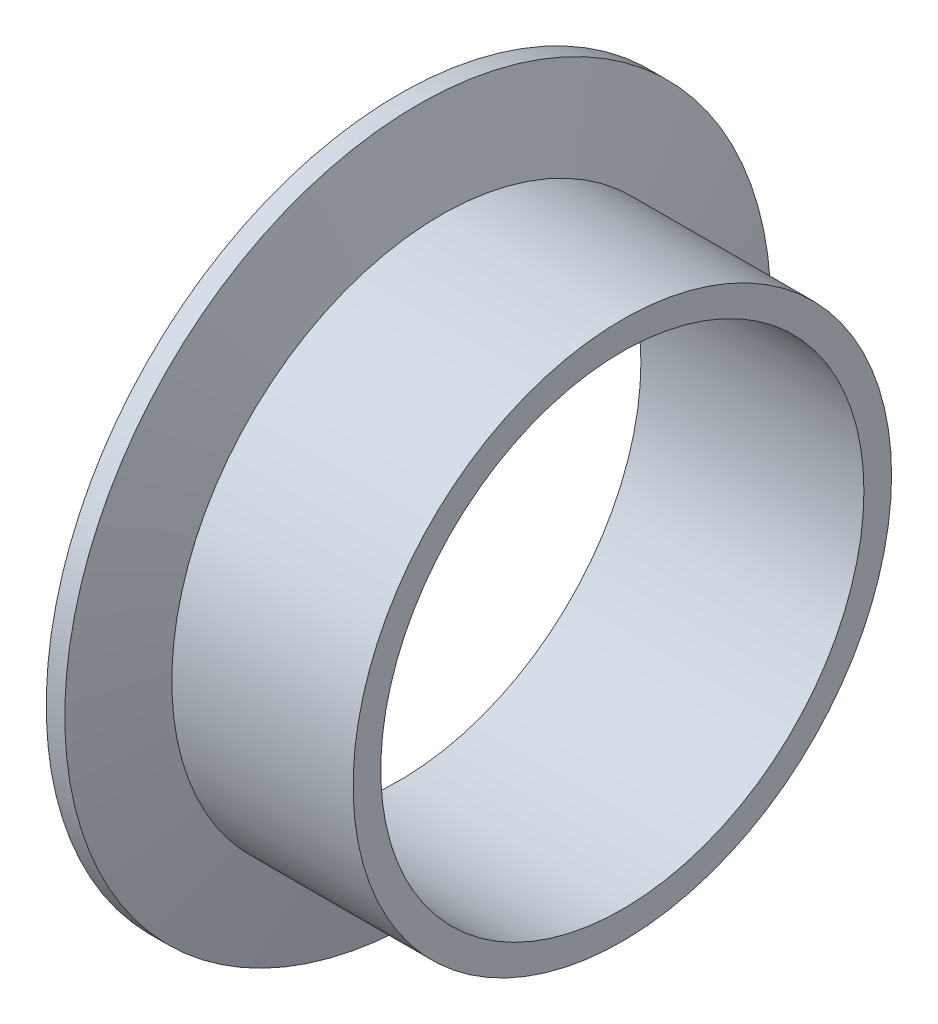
from build123d import *


with BuildPart() as part:
    # Sketch1 → Revolve1 (revolve)
    with BuildSketch(Plane.XY, mode=Mode.PRIVATE) as revolve1_sk:
        Polygon((112.818274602, 22.9997), (97.331978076, 22.9997), (95.355774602, 30.1625), (93.768274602, 30.1625), (93.768274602, 20.6375), (112.818274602, 20.6375), align=None)
    revolve(revolve1_sk.sketch.rotate(Axis((125.720278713, 0, 0), (-1, 0, 0)), 90), axis=Axis((125.720278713, 0, 0), (-1, 0, 0)))


solid = part.part
